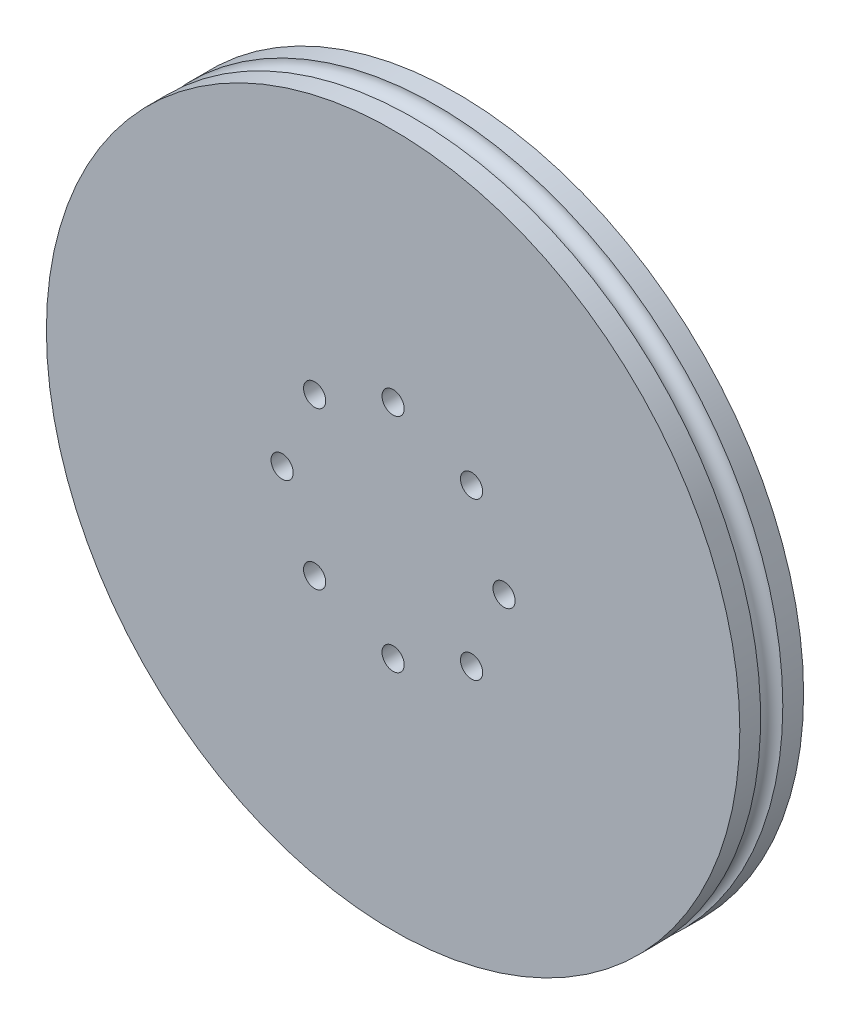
from build123d import *

# Parameters (mm, degrees)
ESQUISSE1_R        = 125
ESQUISSE1_R_2      = 4
BOSS_EXTRU_1_DEPTH = 23
ESQUISSE2_R        = 4


with BuildPart() as part:
    # Esquisse1 → Boss.-Extru.1 (new body)
    with BuildSketch(Plane.XY):
        Circle(ESQUISSE1_R)
        with Locations((0, 40)):
            Circle(ESQUISSE1_R_2, mode=Mode.SUBTRACT)
        with Locations((28.284564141, 28.284978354)):
            Circle(ESQUISSE1_R_2, mode=Mode.SUBTRACT)
        with Locations((40.001, 0.001)):
            Circle(ESQUISSE1_R_2, mode=Mode.SUBTRACT)
        with Locations((28.285978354, -28.283564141)):
            Circle(ESQUISSE1_R_2, mode=Mode.SUBTRACT)
        with Locations((0.002, -40)):
            Circle(ESQUISSE1_R_2, mode=Mode.SUBTRACT)
        with Locations((-28.282564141, -28.284978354)):
            Circle(ESQUISSE1_R_2, mode=Mode.SUBTRACT)
        with Locations((-39.999, -0.001)):
            Circle(ESQUISSE1_R_2, mode=Mode.SUBTRACT)
        with Locations((-28.283978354, 28.283564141)):
            Circle(ESQUISSE1_R_2, mode=Mode.SUBTRACT)
    extrude(amount=BOSS_EXTRU_1_DEPTH)

    # Esquisse2 → Enl_vement de mati_re-R_volution1 (revolve, cut)
    with BuildSketch(Plane(origin=(0, 0, 0), x_dir=(1, 0, 0), z_dir=(0, 1, 0)), mode=Mode.PRIVATE) as enl_vement_de_mati_re_r_volution1_sk:
        with Locations((125, -11.5)):
            Circle(ESQUISSE2_R)
    revolve(enl_vement_de_mati_re_r_volution1_sk.sketch.rotate(Axis((0, 0, 0), (0, 0, 1)), 180), axis=Axis((0, 0, 0), (0, 0, 1)), mode=Mode.SUBTRACT)


solid = part.part
